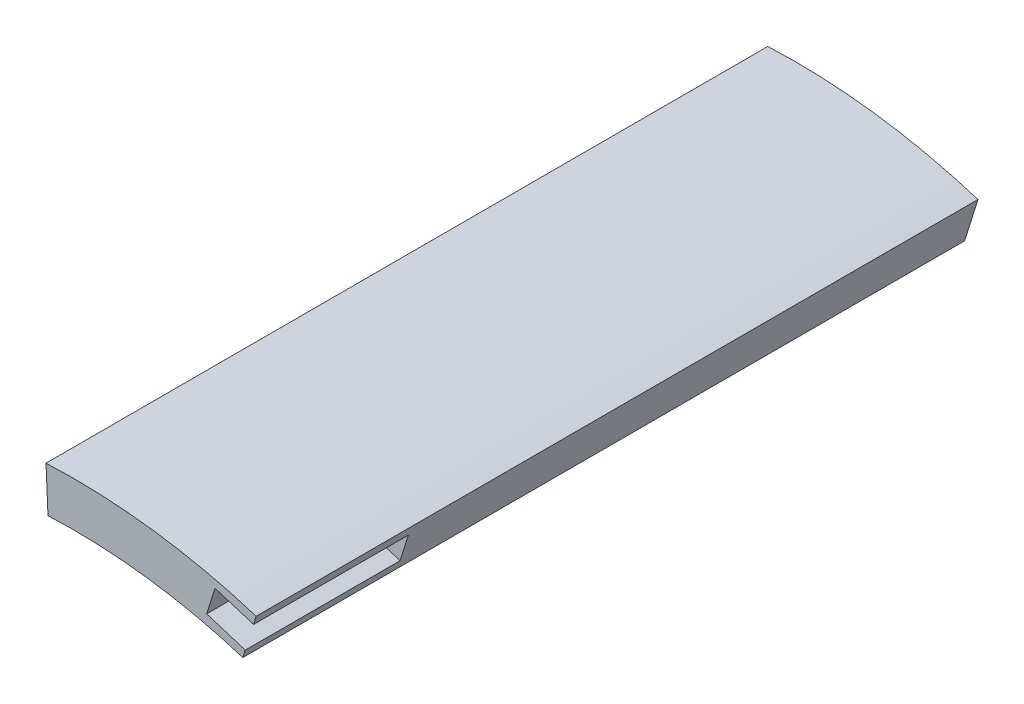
from build123d import *

# Parameters (mm, degrees)
SKICA1_W                 = 280
SKICA1_H                 = 280
P_IDAT_VYSUNUT_M1_DEPTH  = 162
ODEBRAT_VYSUNUT_M1_DEPTH = 353.482623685
SKICA3_W                 = 280
SKICA3_H                 = 280
ODEBRAT_VYSUNUT_M3_DEPTH = 256.820249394
P_IDAT_VYSUNUT_M3_DEPTH  = 162
ODEBRAT_VYSUNUT_M4_DEPTH = 34.75
M_TKO1_SCALE             = 0.655


with BuildPart() as part:
    # Skica1 → P_idat vysunut_m1 (new body)
    with BuildSketch(Plane.XY):
        Rectangle(SKICA1_W, SKICA1_H)
    extrude(amount=P_IDAT_VYSUNUT_M1_DEPTH)

    # Skica2 → Odebrat vysunut_m1 (cut, through all)
    with BuildSketch(Plane(origin=(0, 140, 0), x_dir=(1, 0, 0), z_dir=(0, 1, 0))):
        with BuildLine():
            Line((0, -7.25), (-140, -7.25))
            Line((-140, -7.25), (-140, -14.75))
            Line((-140, -14.75), (0, -14.75))
            ThreePointArc((0, -14.75), (21.25, -36), (0, -57.25))
            Line((0, -57.25), (-140, -57.25))
            Line((-140, -57.25), (-140, -64.75))
            Line((-140, -64.75), (0, -64.75))
            ThreePointArc((0, -64.75), (28.75, -36), (0, -7.25))
        make_face()
        with BuildLine():
            Line((0, -17.25), (-140, -17.25))
            Line((-140, -17.25), (-140, -24.75))
            Line((-140, -24.75), (0, -24.75))
            ThreePointArc((0, -24.75), (11.25, -36), (0, -47.25))
            Line((0, -47.25), (-140, -47.25))
            Line((-140, -47.25), (-140, -54.75))
            Line((-140, -54.75), (0, -54.75))
            ThreePointArc((0, -54.75), (18.75, -36), (0, -17.25))
        make_face()
        with BuildLine():
            Line((-140, -147.25), (-140, -154.75))
            Line((-140, -154.75), (40, -154.75))
            Line((40, -154.75), (40, -134.75))
            ThreePointArc((40, -134.75), (37.940068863, -129.582818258), (32.890213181, -127.25))
            Line((32.890213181, -127.25), (-140, -127.25))
            Line((-140, -127.25), (-140, -134.75))
            Line((-140, -134.75), (24.555944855, -134.75))
            ThreePointArc((24.555944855, -134.75), (26.323711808, -135.482233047), (27.055944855, -137.25))
            Line((27.055944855, -137.25), (-140, -137.25))
            Line((-140, -137.25), (-140, -144.75))
            Line((-140, -144.75), (24.555944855, -144.75))
            ThreePointArc((24.555944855, -144.75), (26.323711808, -145.482233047), (27.055944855, -147.25))
            Line((27.055944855, -147.25), (-140, -147.25))
        make_face()
        with BuildLine():
            Line((0, -27.25), (-140, -27.25))
            Line((-140, -27.25), (-140, -34.75))
            Line((-140, -34.75), (0, -34.75))
            ThreePointArc((0, -34.75), (1.25, -36), (0, -37.25))
            Line((0, -37.25), (-140, -37.25))
            Line((-140, -37.25), (-140, -44.75))
            Line((-140, -44.75), (0, -44.75))
            ThreePointArc((0, -44.75), (8.75, -36), (0, -27.25))
        make_face()
        with BuildLine():
            Line((0, -67.25), (-140, -67.25))
            Line((-140, -67.25), (-140, -74.75))
            Line((-140, -74.75), (0, -74.75))
            ThreePointArc((0, -74.75), (21.25, -96), (0, -117.25))
            Line((0, -117.25), (-140, -117.25))
            Line((-140, -117.25), (-140, -124.75))
            Line((-140, -124.75), (0, -124.75))
            ThreePointArc((0, -124.75), (28.75, -96), (0, -67.25))
        make_face()
        with BuildLine():
            Line((0, -77.25), (-140, -77.25))
            Line((-140, -77.25), (-140, -84.75))
            Line((-140, -84.75), (0, -84.75))
            ThreePointArc((0, -84.75), (11.25, -96), (0, -107.25))
            Line((0, -107.25), (-140, -107.25))
            Line((-140, -107.25), (-140, -114.75))
            Line((-140, -114.75), (0, -114.75))
            ThreePointArc((0, -114.75), (18.75, -96), (0, -77.25))
        make_face()
        with BuildLine():
            Line((0, -87.25), (-140, -87.25))
            Line((-140, -87.25), (-140, -94.75))
            Line((-140, -94.75), (0, -94.75))
            ThreePointArc((0, -94.75), (1.25, -96), (0, -97.25))
            Line((0, -97.25), (-140, -97.25))
            Line((-140, -97.25), (-140, -104.75))
            Line((-140, -104.75), (0, -104.75))
            ThreePointArc((0, -104.75), (8.75, -96), (0, -87.25))
        make_face()
    extrude(amount=-ODEBRAT_VYSUNUT_M1_DEPTH, mode=Mode.SUBTRACT)


with BuildPart() as odebrat_vysunut_m1_piece_1:
    # of the separate pieces the step leaves, piece 1, a body of its own (odebrat_vysunut_m1_pieces)
    add(part.part.solids().sort_by_distance((140, -140, 0))[0])


with BuildPart() as odebrat_vysunut_m1_piece_2:
    # of the separate pieces the step leaves, piece 2, a body of its own (odebrat_vysunut_m1_pieces)
    add(part.part.solids().sort_by_distance((-140, -140, 74.75))[0])


with BuildPart() as odebrat_vysunut_m1_piece_3:
    # of the separate pieces the step leaves, piece 3, a body of its own (odebrat_vysunut_m1_pieces)
    add(part.part.solids().sort_by_distance((-140, -140, 14.75))[0])


with BuildPart() as odebrat_vysunut_m1_piece_4:
    # of the separate pieces the step leaves, piece 4, a body of its own (odebrat_vysunut_m1_pieces)
    add(part.part.solids().sort_by_distance((-140, -140, 84.75))[0])


with BuildPart() as odebrat_vysunut_m1_piece_5:
    # of the separate pieces the step leaves, piece 5, a body of its own (odebrat_vysunut_m1_pieces)
    add(part.part.solids().sort_by_distance((-140, -140, 24.75))[0])


with BuildPart() as odebrat_vysunut_m1_piece_6:
    # of the separate pieces the step leaves, piece 6, a body of its own (odebrat_vysunut_m1_pieces)
    add(part.part.solids().sort_by_distance((-140, -140, 137.25))[0])


with BuildPart() as odebrat_vysunut_m1_piece_7:
    # of the separate pieces the step leaves, piece 7, a body of its own (odebrat_vysunut_m1_pieces)
    add(part.part.solids().sort_by_distance((-140, -140, 147.25))[0])


with BuildPart() as odebrat_vysunut_m1_piece_8:
    # of the separate pieces the step leaves, piece 8, a body of its own (odebrat_vysunut_m1_pieces)
    add(part.part.solids().sort_by_distance((-140, -140, 94.75))[0])


with BuildPart() as odebrat_vysunut_m1_piece_9:
    # of the separate pieces the step leaves, piece 9, a body of its own (odebrat_vysunut_m1_pieces)
    add(part.part.solids().sort_by_distance((-140, -140, 34.75))[0])


with BuildPart() as odebrat_vysunut_m3_tool:
    # Skica3 → Odebrat vysunut_m3 (new, through all)
    with BuildSketch(Plane(origin=(0, 0, 0), x_dir=(-1, 0, 0), z_dir=(0, 0, -1))):
        Rectangle(SKICA3_W, SKICA3_H)
        with BuildLine():
            ThreePointArc((-40, 127.366596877), (-17.275332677, 132.377539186), (5.974236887, 133.366256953))
            Line((5.974236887, 133.366256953), (5.839984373, 130.369262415))
            ThreePointArc((5.839984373, 130.369262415), (-16.887122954, 129.402763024), (-39.101123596, 124.504426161))
            Line((-39.101123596, 124.504426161), (-40, 127.366596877))
        make_face(mode=Mode.SUBTRACT)
    extrude(amount=-ODEBRAT_VYSUNUT_M3_DEPTH)


with BuildPart() as odebrat_vysunut_m1_piece_1_1:
    add(odebrat_vysunut_m1_piece_1.part)

    # Odebrat vysunut_m3: cut by odebrat_vysunut_m3_tool
    add(odebrat_vysunut_m3_tool.part, mode=Mode.SUBTRACT)



with BuildPart() as odebrat_vysunut_m1_piece_2_1:
    add(odebrat_vysunut_m1_piece_2.part)

    # Odebrat vysunut_m3: cut by odebrat_vysunut_m3_tool
    add(odebrat_vysunut_m3_tool.part, mode=Mode.SUBTRACT)


with BuildPart() as odebrat_vysunut_m1_piece_3_1:
    add(odebrat_vysunut_m1_piece_3.part)

    # Odebrat vysunut_m3: cut by odebrat_vysunut_m3_tool
    add(odebrat_vysunut_m3_tool.part, mode=Mode.SUBTRACT)


with BuildPart() as odebrat_vysunut_m1_piece_4_1:
    add(odebrat_vysunut_m1_piece_4.part)

    # Odebrat vysunut_m3: cut by odebrat_vysunut_m3_tool
    add(odebrat_vysunut_m3_tool.part, mode=Mode.SUBTRACT)


with BuildPart() as odebrat_vysunut_m1_piece_5_1:
    add(odebrat_vysunut_m1_piece_5.part)

    # Odebrat vysunut_m3: cut by odebrat_vysunut_m3_tool
    add(odebrat_vysunut_m3_tool.part, mode=Mode.SUBTRACT)


with BuildPart() as odebrat_vysunut_m1_piece_6_1:
    add(odebrat_vysunut_m1_piece_6.part)

    # Odebrat vysunut_m3: cut by odebrat_vysunut_m3_tool
    add(odebrat_vysunut_m3_tool.part, mode=Mode.SUBTRACT)


with BuildPart() as odebrat_vysunut_m1_piece_7_1:
    add(odebrat_vysunut_m1_piece_7.part)

    # Odebrat vysunut_m3: cut by odebrat_vysunut_m3_tool
    add(odebrat_vysunut_m3_tool.part, mode=Mode.SUBTRACT)


with BuildPart() as odebrat_vysunut_m1_piece_8_1:
    add(odebrat_vysunut_m1_piece_8.part)

    # Odebrat vysunut_m3: cut by odebrat_vysunut_m3_tool
    add(odebrat_vysunut_m3_tool.part, mode=Mode.SUBTRACT)


with BuildPart() as odebrat_vysunut_m1_piece_9_1:
    add(odebrat_vysunut_m1_piece_9.part)

    # Odebrat vysunut_m3: cut by odebrat_vysunut_m3_tool
    add(odebrat_vysunut_m3_tool.part, mode=Mode.SUBTRACT)


with BuildPart() as odebrat_vysunut_m1_piece_1_2:
    add(odebrat_vysunut_m1_piece_1_1.part)

    add(odebrat_vysunut_m1_piece_2_1.part)  # P_idat vysunut_m3 merges Odebrat vysunut_m1 piece 2

    add(odebrat_vysunut_m1_piece_3_1.part)  # P_idat vysunut_m3 merges Odebrat vysunut_m1 piece 3

    add(odebrat_vysunut_m1_piece_4_1.part)  # P_idat vysunut_m3 merges Odebrat vysunut_m1 piece 4

    add(odebrat_vysunut_m1_piece_5_1.part)  # P_idat vysunut_m3 merges Odebrat vysunut_m1 piece 5

    add(odebrat_vysunut_m1_piece_6_1.part)  # P_idat vysunut_m3 merges Odebrat vysunut_m1 piece 6

    add(odebrat_vysunut_m1_piece_7_1.part)  # P_idat vysunut_m3 merges Odebrat vysunut_m1 piece 7

    add(odebrat_vysunut_m1_piece_8_1.part)  # P_idat vysunut_m3 merges Odebrat vysunut_m1 piece 8

    add(odebrat_vysunut_m1_piece_9_1.part)  # P_idat vysunut_m3 merges Odebrat vysunut_m1 piece 9
    # Skica5 → P_idat vysunut_m3 (add, through all)
    with BuildSketch(Plane.XY.offset(162)):
        with BuildLine():
            ThreePointArc((39.101123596, 124.504426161), (16.887122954, 129.402763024), (-5.839984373, 130.369262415))
            Line((-5.839984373, 130.369262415), (-5.68335644, 126.872768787))
            ThreePointArc((-5.68335644, 126.872768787), (16.43421161, 125.932190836), (38.052434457, 121.165226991))
            Line((38.052434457, 121.165226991), (39.101123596, 124.504426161))
        make_face()
        with BuildLine():
            Line((-6.130864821, 136.862750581), (-5.974236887, 133.366256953))
            ThreePointArc((-5.974236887, 133.366256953), (17.275332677, 132.377539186), (40, 127.366596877))
            Line((40, 127.366596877), (41.048689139, 130.705796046))
            ThreePointArc((41.048689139, 130.705796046), (17.728244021, 135.848111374), (-6.130864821, 136.862750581))
        make_face()
    extrude(amount=-P_IDAT_VYSUNUT_M3_DEPTH)

    # Skica6 → Odebrat vysunut_m4 (cut)
    with BuildSketch(Plane.XY.offset(162)):
        with BuildLine():
            Line((29.941460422, 125.609672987), (38.594756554, 122.89206999))
            Line((38.594756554, 122.89206999), (40.449438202, 128.797682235))
            ThreePointArc((40.449438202, 128.797682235), (36.09748897, 130.084477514), (31.704747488, 131.224269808))
            Line((31.704747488, 131.224269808), (29.941460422, 125.609672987))
        make_face()
        with BuildLine():
            ThreePointArc((31.704747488, 131.224269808), (36.09748897, 130.084477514), (40.449438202, 128.797682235))
            Line((40.449438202, 128.797682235), (31.79614207, 131.515285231))
            Line((31.79614207, 131.515285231), (31.704747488, 131.224269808))
        make_face()
    extrude(amount=-ODEBRAT_VYSUNUT_M4_DEPTH, mode=Mode.SUBTRACT)


with BuildPart() as odebrat_vysunut_m1_piece_1_3:
    # M_tko1: scaled about (17.56243369, 130.227114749, 78.457778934)
    add(odebrat_vysunut_m1_piece_1_2.part.scale(M_TKO1_SCALE).moved(Location((6.059039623, 44.928354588, 27.067933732))))


solid = odebrat_vysunut_m1_piece_1_3.part
